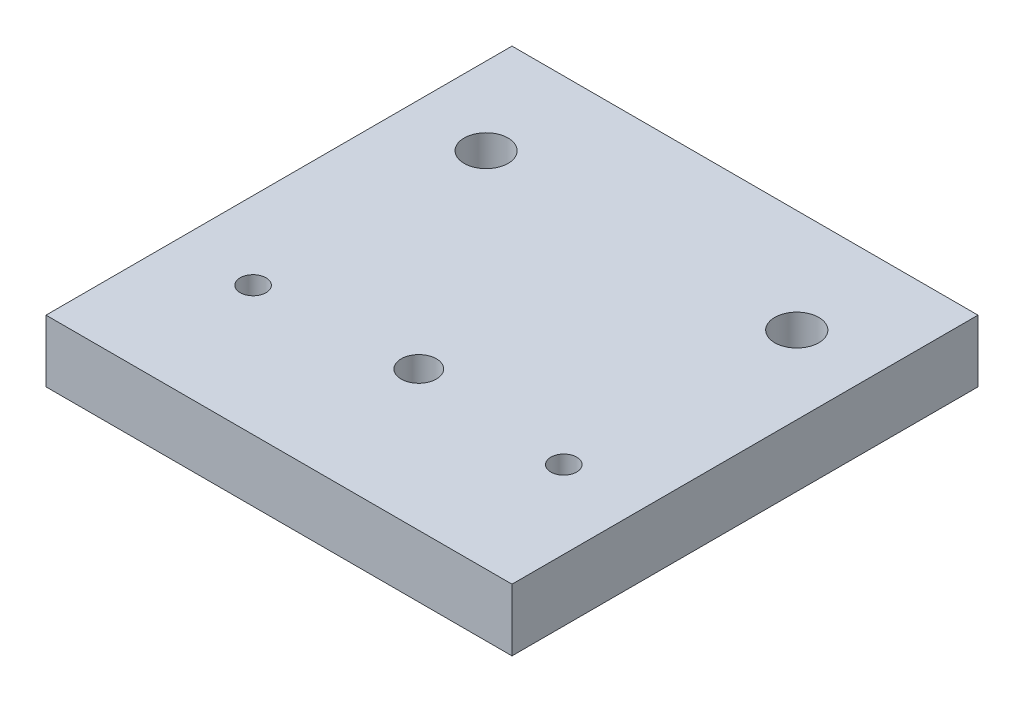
ISO-10303-21;
HEADER;
FILE_DESCRIPTION(('STEP AP214'),'2;1');
FILE_NAME('part.step','',(''),(''),'','','');
FILE_SCHEMA(('AUTOMOTIVE_DESIGN { 1 0 10303 214 1 1 1 1 }'));
ENDSEC;
DATA;
#1=APPLICATION_CONTEXT('core data for automotive mechanical design processes');
#2=APPLICATION_PROTOCOL_DEFINITION('international standard','automotive_design',2000,#1);
#3=PRODUCT_CONTEXT('',#1,'mechanical');
#4=PRODUCT('Part','Part','',(#3));
#5=PRODUCT_RELATED_PRODUCT_CATEGORY('part','',(#4));
#6=PRODUCT_DEFINITION_FORMATION('','',#4);
#7=PRODUCT_DEFINITION_CONTEXT('part definition',#1,'design');
#8=PRODUCT_DEFINITION('design','',#6,#7);
#9=PRODUCT_DEFINITION_SHAPE('','',#8);
#10=(LENGTH_UNIT() NAMED_UNIT(*) SI_UNIT(.MILLI.,.METRE.));
#11=(NAMED_UNIT(*) PLANE_ANGLE_UNIT() SI_UNIT($,.RADIAN.));
#12=(NAMED_UNIT(*) SI_UNIT($,.STERADIAN.) SOLID_ANGLE_UNIT());
#13=UNCERTAINTY_MEASURE_WITH_UNIT(LENGTH_MEASURE(1.E-05),#10,'distance_accuracy_value','');
#14=(GEOMETRIC_REPRESENTATION_CONTEXT(3) GLOBAL_UNCERTAINTY_ASSIGNED_CONTEXT((#13)) GLOBAL_UNIT_ASSIGNED_CONTEXT((#10,
#11,#12)) REPRESENTATION_CONTEXT('',''));
#15=CARTESIAN_POINT('',(0.,0.,0.));
#16=DIRECTION('',(0.,0.,1.));
#17=DIRECTION('',(1.,0.,0.));
#18=AXIS2_PLACEMENT_3D('',#15,#16,#17);
#19=CARTESIAN_POINT('',(0.,0.,0.));
#20=DIRECTION('',(0.,-1.,0.));
#21=DIRECTION('',(0.,0.,-1.));
#22=AXIS2_PLACEMENT_3D('',#19,#20,#21);
#23=PLANE('',#22);
#24=DIRECTION('',(0.,0.,-1.));
#25=VECTOR('',#24,1.);
#26=CARTESIAN_POINT('',(-45.,0.,45.));
#27=LINE('',#26,#25);
#28=CARTESIAN_POINT('',(-45.,0.,45.));
#29=VERTEX_POINT('',#28);
#30=CARTESIAN_POINT('',(-45.,0.,-45.));
#31=VERTEX_POINT('',#30);
#32=EDGE_CURVE('E55',#29,#31,#27,.T.);
#33=ORIENTED_EDGE('',*,*,#32,.T.);
#34=DIRECTION('',(1.,0.,0.));
#35=VECTOR('',#34,1.);
#36=CARTESIAN_POINT('',(-45.,0.,-45.));
#37=LINE('',#36,#35);
#38=CARTESIAN_POINT('',(45.,0.,-45.));
#39=VERTEX_POINT('',#38);
#40=EDGE_CURVE('E274',#31,#39,#37,.T.);
#41=ORIENTED_EDGE('',*,*,#40,.T.);
#42=DIRECTION('',(0.,0.,1.));
#43=VECTOR('',#42,1.);
#44=CARTESIAN_POINT('',(45.,0.,45.));
#45=LINE('',#44,#43);
#46=CARTESIAN_POINT('',(45.,0.,45.));
#47=VERTEX_POINT('',#46);
#48=EDGE_CURVE('E60',#39,#47,#45,.T.);
#49=ORIENTED_EDGE('',*,*,#48,.T.);
#50=DIRECTION('',(-1.,0.,0.));
#51=VECTOR('',#50,1.);
#52=CARTESIAN_POINT('',(-45.,0.,45.));
#53=LINE('',#52,#51);
#54=EDGE_CURVE('E58',#47,#29,#53,.T.);
#55=ORIENTED_EDGE('',*,*,#54,.T.);
#56=EDGE_LOOP('',(#33,#41,#49,#55));
#57=FACE_BOUND('',#56,.T.);
#58=CARTESIAN_POINT('',(30.,0.,20.));
#59=DIRECTION('',(0.,1.,0.));
#60=DIRECTION('',(0.,0.,1.));
#61=AXIS2_PLACEMENT_3D('',#58,#59,#60);
#62=CIRCLE('',#61,2.49999999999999);
#63=CARTESIAN_POINT('',(30.,0.,22.5));
#64=VERTEX_POINT('',#63);
#65=EDGE_CURVE('E66',#64,#64,#62,.T.);
#66=ORIENTED_EDGE('',*,*,#65,.T.);
#67=EDGE_LOOP('',(#66));
#68=FACE_BOUND('',#67,.T.);
#69=CARTESIAN_POINT('',(-30.,0.,20.));
#70=DIRECTION('',(0.,1.,0.));
#71=DIRECTION('',(0.,0.,1.));
#72=AXIS2_PLACEMENT_3D('',#69,#70,#71);
#73=CIRCLE('',#72,2.49999999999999);
#74=CARTESIAN_POINT('',(-30.,0.,22.5));
#75=VERTEX_POINT('',#74);
#76=EDGE_CURVE('E98',#75,#75,#73,.T.);
#77=ORIENTED_EDGE('',*,*,#76,.T.);
#78=EDGE_LOOP('',(#77));
#79=FACE_BOUND('',#78,.T.);
#80=CARTESIAN_POINT('',(-30.,0.,-25.));
#81=DIRECTION('',(0.,1.,0.));
#82=DIRECTION('',(0.,0.,1.));
#83=AXIS2_PLACEMENT_3D('',#80,#81,#82);
#84=CIRCLE('',#83,4.25);
#85=CARTESIAN_POINT('',(-30.,0.,-20.75));
#86=VERTEX_POINT('',#85);
#87=EDGE_CURVE('E101',#86,#86,#84,.T.);
#88=ORIENTED_EDGE('',*,*,#87,.T.);
#89=EDGE_LOOP('',(#88));
#90=FACE_BOUND('',#89,.T.);
#91=CARTESIAN_POINT('',(30.,0.,-25.));
#92=DIRECTION('',(0.,1.,0.));
#93=DIRECTION('',(0.,0.,1.));
#94=AXIS2_PLACEMENT_3D('',#91,#92,#93);
#95=CIRCLE('',#94,4.25);
#96=CARTESIAN_POINT('',(30.,0.,-20.75));
#97=VERTEX_POINT('',#96);
#98=EDGE_CURVE('E103',#97,#97,#95,.T.);
#99=ORIENTED_EDGE('',*,*,#98,.T.);
#100=EDGE_LOOP('',(#99));
#101=FACE_BOUND('',#100,.T.);
#102=CARTESIAN_POINT('',(0.,0.,18.));
#103=DIRECTION('',(0.,1.,0.));
#104=DIRECTION('',(0.,0.,1.));
#105=AXIS2_PLACEMENT_3D('',#102,#103,#104);
#106=CIRCLE('',#105,3.4);
#107=CARTESIAN_POINT('',(0.,0.,21.4));
#108=VERTEX_POINT('',#107);
#109=EDGE_CURVE('E20',#108,#108,#106,.T.);
#110=ORIENTED_EDGE('',*,*,#109,.T.);
#111=EDGE_LOOP('',(#110));
#112=FACE_BOUND('',#111,.T.);
#113=ADVANCED_FACE('F17',(#57,#68,#79,#90,#101,#112),#23,.T.);
#114=CARTESIAN_POINT('',(0.,12.,18.));
#115=DIRECTION('',(0.,1.,0.));
#116=DIRECTION('',(0.,0.,1.));
#117=AXIS2_PLACEMENT_3D('',#114,#115,#116);
#118=CYLINDRICAL_SURFACE('',#117,3.4);
#119=ORIENTED_EDGE('',*,*,#109,.F.);
#120=EDGE_LOOP('',(#119));
#121=FACE_BOUND('',#120,.T.);
#122=CARTESIAN_POINT('',(0.,12.,18.));
#123=DIRECTION('',(0.,1.,0.));
#124=DIRECTION('',(0.,0.,1.));
#125=AXIS2_PLACEMENT_3D('',#122,#123,#124);
#126=CIRCLE('',#125,3.4);
#127=CARTESIAN_POINT('',(0.,12.,21.4));
#128=VERTEX_POINT('',#127);
#129=EDGE_CURVE('E93',#128,#128,#126,.T.);
#130=ORIENTED_EDGE('',*,*,#129,.T.);
#131=EDGE_LOOP('',(#130));
#132=FACE_BOUND('',#131,.T.);
#133=ADVANCED_FACE('F111',(#121,#132),#118,.F.);
#134=CARTESIAN_POINT('',(30.,0.,-25.));
#135=DIRECTION('',(0.,1.,0.));
#136=DIRECTION('',(0.,0.,1.));
#137=AXIS2_PLACEMENT_3D('',#134,#135,#136);
#138=CYLINDRICAL_SURFACE('',#137,4.25);
#139=ORIENTED_EDGE('',*,*,#98,.F.);
#140=EDGE_LOOP('',(#139));
#141=FACE_BOUND('',#140,.T.);
#142=CARTESIAN_POINT('',(30.,12.,-25.));
#143=DIRECTION('',(0.,1.,0.));
#144=DIRECTION('',(0.,0.,1.));
#145=AXIS2_PLACEMENT_3D('',#142,#143,#144);
#146=CIRCLE('',#145,4.25);
#147=CARTESIAN_POINT('',(30.,12.,-20.75));
#148=VERTEX_POINT('',#147);
#149=EDGE_CURVE('E90',#148,#148,#146,.T.);
#150=ORIENTED_EDGE('',*,*,#149,.T.);
#151=EDGE_LOOP('',(#150));
#152=FACE_BOUND('',#151,.T.);
#153=ADVANCED_FACE('F114',(#141,#152),#138,.F.);
#154=CARTESIAN_POINT('',(-30.,0.,-25.));
#155=DIRECTION('',(0.,1.,0.));
#156=DIRECTION('',(0.,0.,1.));
#157=AXIS2_PLACEMENT_3D('',#154,#155,#156);
#158=CYLINDRICAL_SURFACE('',#157,4.25);
#159=ORIENTED_EDGE('',*,*,#87,.F.);
#160=EDGE_LOOP('',(#159));
#161=FACE_BOUND('',#160,.T.);
#162=CARTESIAN_POINT('',(-30.,12.,-25.));
#163=DIRECTION('',(0.,1.,0.));
#164=DIRECTION('',(0.,0.,1.));
#165=AXIS2_PLACEMENT_3D('',#162,#163,#164);
#166=CIRCLE('',#165,4.25);
#167=CARTESIAN_POINT('',(-30.,12.,-20.75));
#168=VERTEX_POINT('',#167);
#169=EDGE_CURVE('E87',#168,#168,#166,.T.);
#170=ORIENTED_EDGE('',*,*,#169,.T.);
#171=EDGE_LOOP('',(#170));
#172=FACE_BOUND('',#171,.T.);
#173=ADVANCED_FACE('F145',(#161,#172),#158,.F.);
#174=CARTESIAN_POINT('',(-30.,12.,20.));
#175=DIRECTION('',(0.,1.,0.));
#176=DIRECTION('',(0.,0.,1.));
#177=AXIS2_PLACEMENT_3D('',#174,#175,#176);
#178=CYLINDRICAL_SURFACE('',#177,2.49999999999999);
#179=ORIENTED_EDGE('',*,*,#76,.F.);
#180=EDGE_LOOP('',(#179));
#181=FACE_BOUND('',#180,.T.);
#182=CARTESIAN_POINT('',(-30.,12.,20.));
#183=DIRECTION('',(0.,1.,0.));
#184=DIRECTION('',(0.,0.,1.));
#185=AXIS2_PLACEMENT_3D('',#182,#183,#184);
#186=CIRCLE('',#185,2.49999999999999);
#187=CARTESIAN_POINT('',(-30.,12.,22.5));
#188=VERTEX_POINT('',#187);
#189=EDGE_CURVE('E84',#188,#188,#186,.T.);
#190=ORIENTED_EDGE('',*,*,#189,.T.);
#191=EDGE_LOOP('',(#190));
#192=FACE_BOUND('',#191,.T.);
#193=ADVANCED_FACE('F141',(#181,#192),#178,.F.);
#194=CARTESIAN_POINT('',(30.,12.,20.));
#195=DIRECTION('',(0.,1.,0.));
#196=DIRECTION('',(0.,0.,1.));
#197=AXIS2_PLACEMENT_3D('',#194,#195,#196);
#198=CYLINDRICAL_SURFACE('',#197,2.49999999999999);
#199=ORIENTED_EDGE('',*,*,#65,.F.);
#200=EDGE_LOOP('',(#199));
#201=FACE_BOUND('',#200,.T.);
#202=CARTESIAN_POINT('',(30.,12.,20.));
#203=DIRECTION('',(0.,1.,0.));
#204=DIRECTION('',(0.,0.,1.));
#205=AXIS2_PLACEMENT_3D('',#202,#203,#204);
#206=CIRCLE('',#205,2.49999999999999);
#207=CARTESIAN_POINT('',(30.,12.,22.5));
#208=VERTEX_POINT('',#207);
#209=EDGE_CURVE('E81',#208,#208,#206,.T.);
#210=ORIENTED_EDGE('',*,*,#209,.T.);
#211=EDGE_LOOP('',(#210));
#212=FACE_BOUND('',#211,.T.);
#213=ADVANCED_FACE('F138',(#201,#212),#198,.F.);
#214=CARTESIAN_POINT('',(-45.,12.,45.));
#215=DIRECTION('',(0.,0.,-1.));
#216=DIRECTION('',(-1.,0.,0.));
#217=AXIS2_PLACEMENT_3D('',#214,#215,#216);
#218=PLANE('',#217);
#219=DIRECTION('',(0.,1.,0.));
#220=VECTOR('',#219,1.);
#221=CARTESIAN_POINT('',(45.,12.,45.));
#222=LINE('',#221,#220);
#223=CARTESIAN_POINT('',(45.,12.,45.));
#224=VERTEX_POINT('',#223);
#225=EDGE_CURVE('E282',#47,#224,#222,.T.);
#226=ORIENTED_EDGE('',*,*,#225,.T.);
#227=DIRECTION('',(1.,0.,0.));
#228=VECTOR('',#227,1.);
#229=CARTESIAN_POINT('',(0.,12.,45.));
#230=LINE('',#229,#228);
#231=CARTESIAN_POINT('',(-45.,12.,45.));
#232=VERTEX_POINT('',#231);
#233=EDGE_CURVE('E77',#224,#232,#230,.F.);
#234=ORIENTED_EDGE('',*,*,#233,.T.);
#235=DIRECTION('',(0.,1.,0.));
#236=VECTOR('',#235,1.);
#237=CARTESIAN_POINT('',(-45.,12.,45.));
#238=LINE('',#237,#236);
#239=EDGE_CURVE('E65',#232,#29,#238,.F.);
#240=ORIENTED_EDGE('',*,*,#239,.T.);
#241=ORIENTED_EDGE('',*,*,#54,.F.);
#242=EDGE_LOOP('',(#226,#234,#240,#241));
#243=FACE_BOUND('',#242,.T.);
#244=ADVANCED_FACE('F76',(#243),#218,.F.);
#245=CARTESIAN_POINT('',(-45.,12.,45.));
#246=DIRECTION('',(1.,0.,0.));
#247=DIRECTION('',(0.,0.,-1.));
#248=AXIS2_PLACEMENT_3D('',#245,#246,#247);
#249=PLANE('',#248);
#250=ORIENTED_EDGE('',*,*,#239,.F.);
#251=DIRECTION('',(0.,0.,-1.));
#252=VECTOR('',#251,1.);
#253=CARTESIAN_POINT('',(-45.,12.,0.));
#254=LINE('',#253,#252);
#255=CARTESIAN_POINT('',(-45.,12.,-45.));
#256=VERTEX_POINT('',#255);
#257=EDGE_CURVE('E275',#232,#256,#254,.T.);
#258=ORIENTED_EDGE('',*,*,#257,.T.);
#259=DIRECTION('',(0.,1.,0.));
#260=VECTOR('',#259,1.);
#261=CARTESIAN_POINT('',(-45.,12.,-45.));
#262=LINE('',#261,#260);
#263=EDGE_CURVE('E73',#256,#31,#262,.F.);
#264=ORIENTED_EDGE('',*,*,#263,.T.);
#265=ORIENTED_EDGE('',*,*,#32,.F.);
#266=EDGE_LOOP('',(#250,#258,#264,#265));
#267=FACE_BOUND('',#266,.T.);
#268=ADVANCED_FACE('F70',(#267),#249,.F.);
#269=CARTESIAN_POINT('',(-45.,12.,-45.));
#270=DIRECTION('',(0.,0.,1.));
#271=DIRECTION('',(1.,0.,0.));
#272=AXIS2_PLACEMENT_3D('',#269,#270,#271);
#273=PLANE('',#272);
#274=ORIENTED_EDGE('',*,*,#263,.F.);
#275=DIRECTION('',(1.,0.,0.));
#276=VECTOR('',#275,1.);
#277=CARTESIAN_POINT('',(0.,12.,-45.));
#278=LINE('',#277,#276);
#279=CARTESIAN_POINT('',(45.,12.,-45.));
#280=VERTEX_POINT('',#279);
#281=EDGE_CURVE('E26',#256,#280,#278,.T.);
#282=ORIENTED_EDGE('',*,*,#281,.T.);
#283=DIRECTION('',(0.,1.,0.));
#284=VECTOR('',#283,1.);
#285=CARTESIAN_POINT('',(45.,12.,-45.));
#286=LINE('',#285,#284);
#287=EDGE_CURVE('E34',#280,#39,#286,.F.);
#288=ORIENTED_EDGE('',*,*,#287,.T.);
#289=ORIENTED_EDGE('',*,*,#40,.F.);
#290=EDGE_LOOP('',(#274,#282,#288,#289));
#291=FACE_BOUND('',#290,.T.);
#292=ADVANCED_FACE('F126',(#291),#273,.F.);
#293=CARTESIAN_POINT('',(45.,12.,45.));
#294=DIRECTION('',(-1.,0.,0.));
#295=DIRECTION('',(0.,0.,1.));
#296=AXIS2_PLACEMENT_3D('',#293,#294,#295);
#297=PLANE('',#296);
#298=ORIENTED_EDGE('',*,*,#287,.F.);
#299=DIRECTION('',(0.,0.,-1.));
#300=VECTOR('',#299,1.);
#301=CARTESIAN_POINT('',(45.,12.,0.));
#302=LINE('',#301,#300);
#303=EDGE_CURVE('E11',#280,#224,#302,.F.);
#304=ORIENTED_EDGE('',*,*,#303,.T.);
#305=ORIENTED_EDGE('',*,*,#225,.F.);
#306=ORIENTED_EDGE('',*,*,#48,.F.);
#307=EDGE_LOOP('',(#298,#304,#305,#306));
#308=FACE_BOUND('',#307,.T.);
#309=ADVANCED_FACE('F119',(#308),#297,.F.);
#310=CARTESIAN_POINT('',(0.,12.,0.));
#311=DIRECTION('',(0.,-1.,0.));
#312=DIRECTION('',(0.,0.,-1.));
#313=AXIS2_PLACEMENT_3D('',#310,#311,#312);
#314=PLANE('',#313);
#315=ORIENTED_EDGE('',*,*,#281,.F.);
#316=ORIENTED_EDGE('',*,*,#257,.F.);
#317=ORIENTED_EDGE('',*,*,#233,.F.);
#318=ORIENTED_EDGE('',*,*,#303,.F.);
#319=EDGE_LOOP('',(#315,#316,#317,#318));
#320=FACE_BOUND('',#319,.T.);
#321=ORIENTED_EDGE('',*,*,#209,.F.);
#322=EDGE_LOOP('',(#321));
#323=FACE_BOUND('',#322,.T.);
#324=ORIENTED_EDGE('',*,*,#189,.F.);
#325=EDGE_LOOP('',(#324));
#326=FACE_BOUND('',#325,.T.);
#327=ORIENTED_EDGE('',*,*,#169,.F.);
#328=EDGE_LOOP('',(#327));
#329=FACE_BOUND('',#328,.T.);
#330=ORIENTED_EDGE('',*,*,#149,.F.);
#331=EDGE_LOOP('',(#330));
#332=FACE_BOUND('',#331,.T.);
#333=ORIENTED_EDGE('',*,*,#129,.F.);
#334=EDGE_LOOP('',(#333));
#335=FACE_BOUND('',#334,.T.);
#336=ADVANCED_FACE('F117',(#320,#323,#326,#329,#332,#335),#314,.F.);
#337=CLOSED_SHELL('',(#113,#133,#153,#173,#193,#213,#244,#268,#292,#309,#336));
#338=MANIFOLD_SOLID_BREP('B1',#337);
#339=ADVANCED_BREP_SHAPE_REPRESENTATION('',(#18,#338),#14);
#340=SHAPE_DEFINITION_REPRESENTATION(#9,#339);
ENDSEC;
END-ISO-10303-21;
